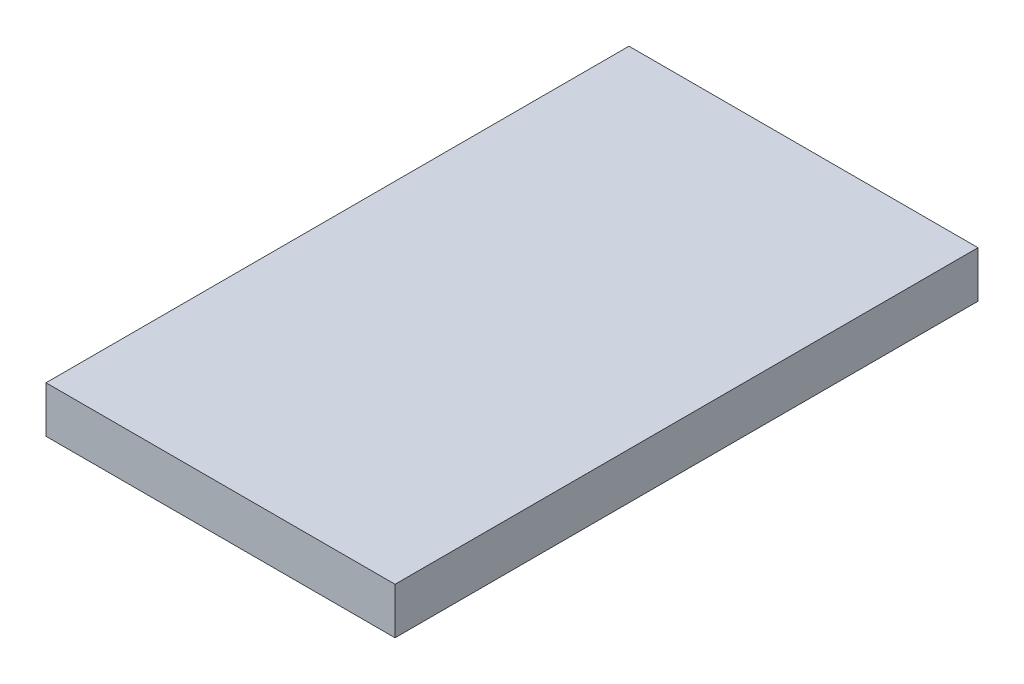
from build123d import *

# Parameters (mm, degrees)
SKETCH1_W           = 120.4
SKETCH1_H           = 201.1
BOSS_EXTRUDE1_DEPTH = 16
SKETCH2_R           = 3.1
CUT_EXTRUDE1_DEPTH  = 5


with BuildPart() as part:
    # Sketch1 → Boss-Extrude1 (new body)
    with BuildSketch(Plane(origin=(0, 0, 0), x_dir=(1, 0, 0), z_dir=(0, 1, 0))):
        Rectangle(SKETCH1_W, SKETCH1_H)
    extrude(amount=BOSS_EXTRUDE1_DEPTH)

    # Sketch2 → Cut-Extrude1 (cut)
    with BuildSketch(Plane.XZ):
        with Locations(Location((-35, 50.85, 0), (0, 0, 270))):
            Circle(SKETCH2_R)
        with Locations(Location((35, 50.85, 0), (0, 0, 270))):
            Circle(SKETCH2_R)
        with Locations(Location((35, -50.85, 0), (0, 0, 270))):
            Circle(SKETCH2_R)
        with Locations(Location((-35, -50.85, 0), (0, 0, 270))):
            Circle(SKETCH2_R)
    extrude(amount=-CUT_EXTRUDE1_DEPTH, mode=Mode.SUBTRACT)


solid = part.part
